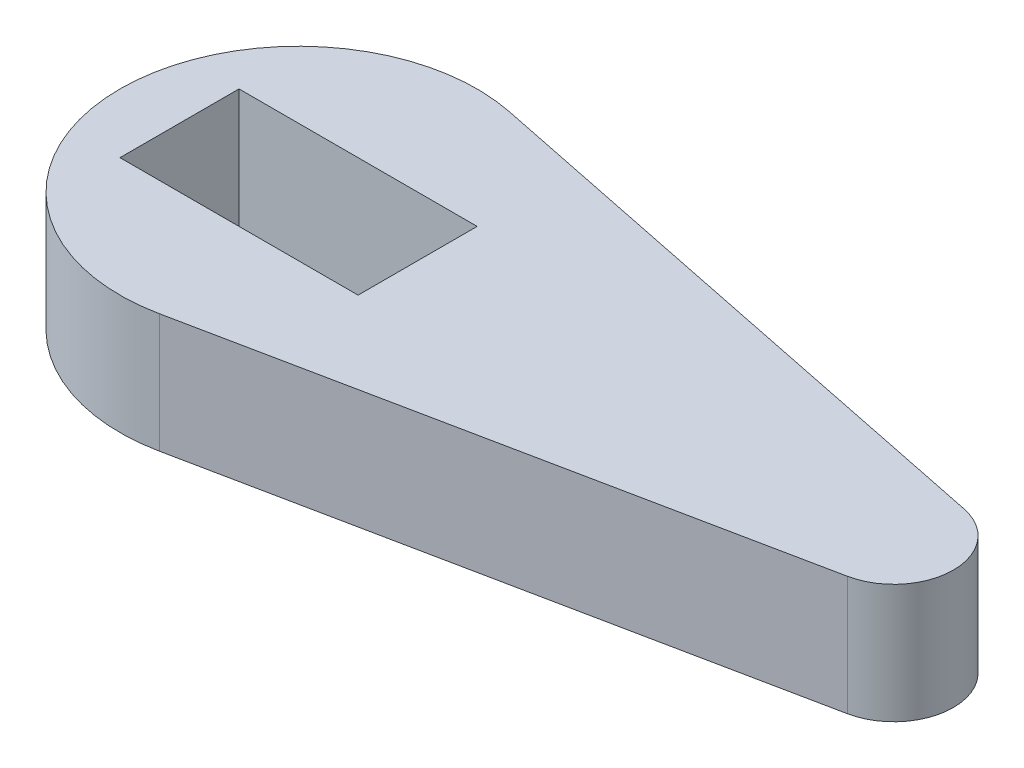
ISO-10303-21;
HEADER;
FILE_DESCRIPTION(('STEP AP214'),'2;1');
FILE_NAME('part.step','',(''),(''),'','','');
FILE_SCHEMA(('AUTOMOTIVE_DESIGN { 1 0 10303 214 1 1 1 1 }'));
ENDSEC;
DATA;
#1=APPLICATION_CONTEXT('core data for automotive mechanical design processes');
#2=APPLICATION_PROTOCOL_DEFINITION('international standard','automotive_design',2000,#1);
#3=PRODUCT_CONTEXT('',#1,'mechanical');
#4=PRODUCT('Part','Part','',(#3));
#5=PRODUCT_RELATED_PRODUCT_CATEGORY('part','',(#4));
#6=PRODUCT_DEFINITION_FORMATION('','',#4);
#7=PRODUCT_DEFINITION_CONTEXT('part definition',#1,'design');
#8=PRODUCT_DEFINITION('design','',#6,#7);
#9=PRODUCT_DEFINITION_SHAPE('','',#8);
#10=(LENGTH_UNIT() NAMED_UNIT(*) SI_UNIT(.MILLI.,.METRE.));
#11=(NAMED_UNIT(*) PLANE_ANGLE_UNIT() SI_UNIT($,.RADIAN.));
#12=(NAMED_UNIT(*) SI_UNIT($,.STERADIAN.) SOLID_ANGLE_UNIT());
#13=UNCERTAINTY_MEASURE_WITH_UNIT(LENGTH_MEASURE(1.E-05),#10,'distance_accuracy_value','');
#14=(GEOMETRIC_REPRESENTATION_CONTEXT(3) GLOBAL_UNCERTAINTY_ASSIGNED_CONTEXT((#13)) GLOBAL_UNIT_ASSIGNED_CONTEXT((#10,
#11,#12)) REPRESENTATION_CONTEXT('',''));
#15=CARTESIAN_POINT('',(0.,0.,0.));
#16=DIRECTION('',(0.,0.,1.));
#17=DIRECTION('',(1.,0.,0.));
#18=AXIS2_PLACEMENT_3D('',#15,#16,#17);
#19=CARTESIAN_POINT('',(0.,3.175,0.));
#20=DIRECTION('',(0.,-1.,0.));
#21=DIRECTION('',(0.,0.,-1.));
#22=AXIS2_PLACEMENT_3D('',#19,#20,#21);
#23=CYLINDRICAL_SURFACE('',#22,4.7625);
#24=CARTESIAN_POINT('',(0.,0.,0.));
#25=DIRECTION('',(0.,1.,0.));
#26=DIRECTION('',(0.,0.,1.));
#27=AXIS2_PLACEMENT_3D('',#24,#25,#26);
#28=CIRCLE('',#27,4.7625);
#29=CARTESIAN_POINT('',(0.9525,0.,-4.66627796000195));
#30=VERTEX_POINT('',#29);
#31=CARTESIAN_POINT('',(0.9525,0.,4.66627796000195));
#32=VERTEX_POINT('',#31);
#33=EDGE_CURVE('E134',#30,#32,#28,.T.);
#34=ORIENTED_EDGE('',*,*,#33,.T.);
#35=DIRECTION('',(0.,-1.,0.));
#36=VECTOR('',#35,1.);
#37=CARTESIAN_POINT('',(0.9525,3.175,4.66627796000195));
#38=LINE('',#37,#36);
#39=CARTESIAN_POINT('',(0.9525,3.175,4.66627796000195));
#40=VERTEX_POINT('',#39);
#41=EDGE_CURVE('E11',#40,#32,#38,.T.);
#42=ORIENTED_EDGE('',*,*,#41,.F.);
#43=CARTESIAN_POINT('',(0.,3.175,0.));
#44=DIRECTION('',(0.,1.,0.));
#45=DIRECTION('',(0.,0.,1.));
#46=AXIS2_PLACEMENT_3D('',#43,#44,#45);
#47=CIRCLE('',#46,4.7625);
#48=CARTESIAN_POINT('',(0.9525,3.175,-4.66627796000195));
#49=VERTEX_POINT('',#48);
#50=EDGE_CURVE('E138',#49,#40,#47,.T.);
#51=ORIENTED_EDGE('',*,*,#50,.F.);
#52=DIRECTION('',(0.,-1.,0.));
#53=VECTOR('',#52,1.);
#54=CARTESIAN_POINT('',(0.9525,3.175,-4.66627796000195));
#55=LINE('',#54,#53);
#56=EDGE_CURVE('E150',#49,#30,#55,.T.);
#57=ORIENTED_EDGE('',*,*,#56,.T.);
#58=EDGE_LOOP('',(#34,#42,#51,#57));
#59=FACE_BOUND('',#58,.T.);
#60=ADVANCED_FACE('F39',(#59),#23,.T.);
#61=CARTESIAN_POINT('',(0.9525,3.175,4.66627796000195));
#62=DIRECTION('',(-0.2,0.,-0.979795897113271));
#63=DIRECTION('',(-0.979795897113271,0.,0.2));
#64=AXIS2_PLACEMENT_3D('',#61,#62,#63);
#65=PLANE('',#64);
#66=DIRECTION('',(0.979795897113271,0.,-0.2));
#67=VECTOR('',#66,1.);
#68=CARTESIAN_POINT('',(0.9525,0.,4.66627796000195));
#69=LINE('',#68,#67);
#70=CARTESIAN_POINT('',(16.1925,0.,1.55542598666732));
#71=VERTEX_POINT('',#70);
#72=EDGE_CURVE('E153',#32,#71,#69,.T.);
#73=ORIENTED_EDGE('',*,*,#72,.T.);
#74=DIRECTION('',(0.,-1.,0.));
#75=VECTOR('',#74,1.);
#76=CARTESIAN_POINT('',(16.1925,3.175,1.55542598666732));
#77=LINE('',#76,#75);
#78=CARTESIAN_POINT('',(16.1925,3.175,1.55542598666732));
#79=VERTEX_POINT('',#78);
#80=EDGE_CURVE('E46',#79,#71,#77,.T.);
#81=ORIENTED_EDGE('',*,*,#80,.F.);
#82=DIRECTION('',(0.979795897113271,0.,-0.2));
#83=VECTOR('',#82,1.);
#84=CARTESIAN_POINT('',(0.9525,3.175,4.66627796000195));
#85=LINE('',#84,#83);
#86=EDGE_CURVE('E141',#40,#79,#85,.T.);
#87=ORIENTED_EDGE('',*,*,#86,.F.);
#88=ORIENTED_EDGE('',*,*,#41,.T.);
#89=EDGE_LOOP('',(#73,#81,#87,#88));
#90=FACE_BOUND('',#89,.T.);
#91=ADVANCED_FACE('F169',(#90),#65,.F.);
#92=CARTESIAN_POINT('',(15.875,3.175,0.));
#93=DIRECTION('',(0.,-1.,0.));
#94=DIRECTION('',(0.,0.,-1.));
#95=AXIS2_PLACEMENT_3D('',#92,#93,#94);
#96=CYLINDRICAL_SURFACE('',#95,1.5875);
#97=CARTESIAN_POINT('',(15.875,0.,0.));
#98=DIRECTION('',(0.,-1.,0.));
#99=DIRECTION('',(0.,0.,-1.));
#100=AXIS2_PLACEMENT_3D('',#97,#98,#99);
#101=CIRCLE('',#100,1.5875);
#102=CARTESIAN_POINT('',(16.1925,0.,-1.55542598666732));
#103=VERTEX_POINT('',#102);
#104=EDGE_CURVE('E156',#103,#71,#101,.T.);
#105=ORIENTED_EDGE('',*,*,#104,.F.);
#106=DIRECTION('',(0.,-1.,0.));
#107=VECTOR('',#106,1.);
#108=CARTESIAN_POINT('',(16.1925,3.175,-1.55542598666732));
#109=LINE('',#108,#107);
#110=CARTESIAN_POINT('',(16.1925,3.175,-1.55542598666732));
#111=VERTEX_POINT('',#110);
#112=EDGE_CURVE('E162',#111,#103,#109,.T.);
#113=ORIENTED_EDGE('',*,*,#112,.F.);
#114=CARTESIAN_POINT('',(15.875,3.175,0.));
#115=DIRECTION('',(0.,-1.,0.));
#116=DIRECTION('',(0.,0.,-1.));
#117=AXIS2_PLACEMENT_3D('',#114,#115,#116);
#118=CIRCLE('',#117,1.5875);
#119=EDGE_CURVE('E144',#111,#79,#118,.T.);
#120=ORIENTED_EDGE('',*,*,#119,.T.);
#121=ORIENTED_EDGE('',*,*,#80,.T.);
#122=EDGE_LOOP('',(#105,#113,#120,#121));
#123=FACE_BOUND('',#122,.T.);
#124=ADVANCED_FACE('F166',(#123),#96,.T.);
#125=CARTESIAN_POINT('',(0.9525,3.175,-4.66627796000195));
#126=DIRECTION('',(0.2,0.,-0.979795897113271));
#127=DIRECTION('',(-0.979795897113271,0.,-0.2));
#128=AXIS2_PLACEMENT_3D('',#125,#126,#127);
#129=PLANE('',#128);
#130=DIRECTION('',(0.979795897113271,0.,0.2));
#131=VECTOR('',#130,1.);
#132=CARTESIAN_POINT('',(0.9525,0.,-4.66627796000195));
#133=LINE('',#132,#131);
#134=EDGE_CURVE('E142',#30,#103,#133,.T.);
#135=ORIENTED_EDGE('',*,*,#134,.F.);
#136=ORIENTED_EDGE('',*,*,#56,.F.);
#137=DIRECTION('',(0.979795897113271,0.,0.2));
#138=VECTOR('',#137,1.);
#139=CARTESIAN_POINT('',(0.9525,3.175,-4.66627796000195));
#140=LINE('',#139,#138);
#141=EDGE_CURVE('E147',#49,#111,#140,.T.);
#142=ORIENTED_EDGE('',*,*,#141,.T.);
#143=ORIENTED_EDGE('',*,*,#112,.T.);
#144=EDGE_LOOP('',(#135,#136,#142,#143));
#145=FACE_BOUND('',#144,.T.);
#146=ADVANCED_FACE('F174',(#145),#129,.T.);
#147=CARTESIAN_POINT('',(0.,3.175,0.));
#148=DIRECTION('',(0.,1.,0.));
#149=DIRECTION('',(0.,0.,1.));
#150=AXIS2_PLACEMENT_3D('',#147,#148,#149);
#151=PLANE('',#150);
#152=DIRECTION('',(1.,0.,0.));
#153=VECTOR('',#152,1.);
#154=CARTESIAN_POINT('',(-3.175,3.175,1.5875));
#155=LINE('',#154,#153);
#156=CARTESIAN_POINT('',(-3.175,3.175,1.5875));
#157=VERTEX_POINT('',#156);
#158=CARTESIAN_POINT('',(3.175,3.175,1.5875));
#159=VERTEX_POINT('',#158);
#160=EDGE_CURVE('E53',#157,#159,#155,.T.);
#161=ORIENTED_EDGE('',*,*,#160,.F.);
#162=DIRECTION('',(0.,0.,-1.));
#163=VECTOR('',#162,1.);
#164=CARTESIAN_POINT('',(-3.175,3.175,1.5875));
#165=LINE('',#164,#163);
#166=CARTESIAN_POINT('',(-3.175,3.175,-1.5875));
#167=VERTEX_POINT('',#166);
#168=EDGE_CURVE('E119',#157,#167,#165,.T.);
#169=ORIENTED_EDGE('',*,*,#168,.T.);
#170=DIRECTION('',(1.,0.,0.));
#171=VECTOR('',#170,1.);
#172=CARTESIAN_POINT('',(-3.175,3.175,-1.5875));
#173=LINE('',#172,#171);
#174=CARTESIAN_POINT('',(3.175,3.175,-1.5875));
#175=VERTEX_POINT('',#174);
#176=EDGE_CURVE('E122',#167,#175,#173,.T.);
#177=ORIENTED_EDGE('',*,*,#176,.T.);
#178=DIRECTION('',(0.,0.,-1.));
#179=VECTOR('',#178,1.);
#180=CARTESIAN_POINT('',(3.175,3.175,1.5875));
#181=LINE('',#180,#179);
#182=EDGE_CURVE('E128',#159,#175,#181,.T.);
#183=ORIENTED_EDGE('',*,*,#182,.F.);
#184=EDGE_LOOP('',(#161,#169,#177,#183));
#185=FACE_BOUND('',#184,.T.);
#186=ORIENTED_EDGE('',*,*,#50,.T.);
#187=ORIENTED_EDGE('',*,*,#86,.T.);
#188=ORIENTED_EDGE('',*,*,#119,.F.);
#189=ORIENTED_EDGE('',*,*,#141,.F.);
#190=EDGE_LOOP('',(#186,#187,#188,#189));
#191=FACE_BOUND('',#190,.T.);
#192=ADVANCED_FACE('F178',(#185,#191),#151,.T.);
#193=CARTESIAN_POINT('',(0.,0.,0.));
#194=DIRECTION('',(0.,1.,0.));
#195=DIRECTION('',(0.,0.,1.));
#196=AXIS2_PLACEMENT_3D('',#193,#194,#195);
#197=PLANE('',#196);
#198=DIRECTION('',(0.,0.,-1.));
#199=VECTOR('',#198,1.);
#200=CARTESIAN_POINT('',(-3.175,0.,1.5875));
#201=LINE('',#200,#199);
#202=CARTESIAN_POINT('',(-3.175,0.,1.5875));
#203=VERTEX_POINT('',#202);
#204=CARTESIAN_POINT('',(-3.175,0.,-1.5875));
#205=VERTEX_POINT('',#204);
#206=EDGE_CURVE('E108',#203,#205,#201,.T.);
#207=ORIENTED_EDGE('',*,*,#206,.F.);
#208=DIRECTION('',(1.,0.,0.));
#209=VECTOR('',#208,1.);
#210=CARTESIAN_POINT('',(-3.175,0.,1.5875));
#211=LINE('',#210,#209);
#212=CARTESIAN_POINT('',(3.175,0.,1.5875));
#213=VERTEX_POINT('',#212);
#214=EDGE_CURVE('E105',#203,#213,#211,.T.);
#215=ORIENTED_EDGE('',*,*,#214,.T.);
#216=DIRECTION('',(0.,0.,-1.));
#217=VECTOR('',#216,1.);
#218=CARTESIAN_POINT('',(3.175,0.,1.5875));
#219=LINE('',#218,#217);
#220=CARTESIAN_POINT('',(3.175,0.,-1.5875));
#221=VERTEX_POINT('',#220);
#222=EDGE_CURVE('E111',#213,#221,#219,.T.);
#223=ORIENTED_EDGE('',*,*,#222,.T.);
#224=DIRECTION('',(1.,0.,0.));
#225=VECTOR('',#224,1.);
#226=CARTESIAN_POINT('',(-3.175,0.,-1.5875));
#227=LINE('',#226,#225);
#228=EDGE_CURVE('E115',#205,#221,#227,.T.);
#229=ORIENTED_EDGE('',*,*,#228,.F.);
#230=EDGE_LOOP('',(#207,#215,#223,#229));
#231=FACE_BOUND('',#230,.T.);
#232=ORIENTED_EDGE('',*,*,#33,.F.);
#233=ORIENTED_EDGE('',*,*,#134,.T.);
#234=ORIENTED_EDGE('',*,*,#104,.T.);
#235=ORIENTED_EDGE('',*,*,#72,.F.);
#236=EDGE_LOOP('',(#232,#233,#234,#235));
#237=FACE_BOUND('',#236,.T.);
#238=ADVANCED_FACE('F117',(#231,#237),#197,.F.);
#239=CARTESIAN_POINT('',(-3.175,0.,1.5875));
#240=DIRECTION('',(0.,0.,1.));
#241=DIRECTION('',(1.,0.,0.));
#242=AXIS2_PLACEMENT_3D('',#239,#240,#241);
#243=PLANE('',#242);
#244=ORIENTED_EDGE('',*,*,#160,.T.);
#245=DIRECTION('',(0.,1.,0.));
#246=VECTOR('',#245,1.);
#247=CARTESIAN_POINT('',(3.175,0.,1.5875));
#248=LINE('',#247,#246);
#249=EDGE_CURVE('E102',#213,#159,#248,.T.);
#250=ORIENTED_EDGE('',*,*,#249,.F.);
#251=ORIENTED_EDGE('',*,*,#214,.F.);
#252=DIRECTION('',(0.,1.,0.));
#253=VECTOR('',#252,1.);
#254=CARTESIAN_POINT('',(-3.175,0.,1.5875));
#255=LINE('',#254,#253);
#256=EDGE_CURVE('E132',#203,#157,#255,.T.);
#257=ORIENTED_EDGE('',*,*,#256,.T.);
#258=EDGE_LOOP('',(#244,#250,#251,#257));
#259=FACE_BOUND('',#258,.T.);
#260=ADVANCED_FACE('F103',(#259),#243,.F.);
#261=CARTESIAN_POINT('',(-3.175,0.,1.5875));
#262=DIRECTION('',(1.,0.,0.));
#263=DIRECTION('',(0.,0.,-1.));
#264=AXIS2_PLACEMENT_3D('',#261,#262,#263);
#265=PLANE('',#264);
#266=ORIENTED_EDGE('',*,*,#168,.F.);
#267=ORIENTED_EDGE('',*,*,#256,.F.);
#268=ORIENTED_EDGE('',*,*,#206,.T.);
#269=DIRECTION('',(0.,1.,0.));
#270=VECTOR('',#269,1.);
#271=CARTESIAN_POINT('',(-3.175,0.,-1.5875));
#272=LINE('',#271,#270);
#273=EDGE_CURVE('E135',#205,#167,#272,.T.);
#274=ORIENTED_EDGE('',*,*,#273,.T.);
#275=EDGE_LOOP('',(#266,#267,#268,#274));
#276=FACE_BOUND('',#275,.T.);
#277=ADVANCED_FACE('F198',(#276),#265,.T.);
#278=CARTESIAN_POINT('',(-3.175,0.,-1.5875));
#279=DIRECTION('',(0.,0.,1.));
#280=DIRECTION('',(1.,0.,0.));
#281=AXIS2_PLACEMENT_3D('',#278,#279,#280);
#282=PLANE('',#281);
#283=ORIENTED_EDGE('',*,*,#176,.F.);
#284=ORIENTED_EDGE('',*,*,#273,.F.);
#285=ORIENTED_EDGE('',*,*,#228,.T.);
#286=DIRECTION('',(0.,1.,0.));
#287=VECTOR('',#286,1.);
#288=CARTESIAN_POINT('',(3.175,0.,-1.5875));
#289=LINE('',#288,#287);
#290=EDGE_CURVE('E61',#221,#175,#289,.T.);
#291=ORIENTED_EDGE('',*,*,#290,.T.);
#292=EDGE_LOOP('',(#283,#284,#285,#291));
#293=FACE_BOUND('',#292,.T.);
#294=ADVANCED_FACE('F201',(#293),#282,.T.);
#295=CARTESIAN_POINT('',(3.175,0.,1.5875));
#296=DIRECTION('',(1.,0.,0.));
#297=DIRECTION('',(0.,0.,-1.));
#298=AXIS2_PLACEMENT_3D('',#295,#296,#297);
#299=PLANE('',#298);
#300=ORIENTED_EDGE('',*,*,#182,.T.);
#301=ORIENTED_EDGE('',*,*,#290,.F.);
#302=ORIENTED_EDGE('',*,*,#222,.F.);
#303=ORIENTED_EDGE('',*,*,#249,.T.);
#304=EDGE_LOOP('',(#300,#301,#302,#303));
#305=FACE_BOUND('',#304,.T.);
#306=ADVANCED_FACE('F112',(#305),#299,.F.);
#307=CLOSED_SHELL('',(#60,#91,#124,#146,#192,#238,#260,#277,#294,#306));
#308=MANIFOLD_SOLID_BREP('B2',#307);
#309=ADVANCED_BREP_SHAPE_REPRESENTATION('',(#18,#308),#14);
#310=SHAPE_DEFINITION_REPRESENTATION(#9,#309);
ENDSEC;
END-ISO-10303-21;
